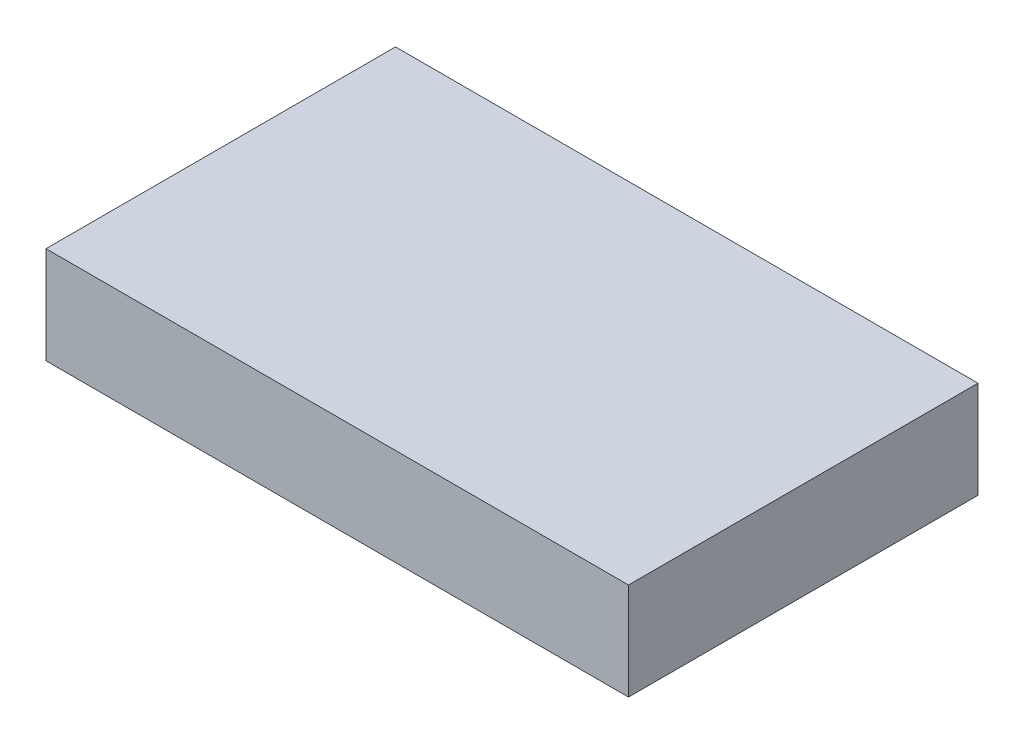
ISO-10303-21;
HEADER;
FILE_DESCRIPTION(('STEP AP214'),'2;1');
FILE_NAME('part.step','',(''),(''),'','','');
FILE_SCHEMA(('AUTOMOTIVE_DESIGN { 1 0 10303 214 1 1 1 1 }'));
ENDSEC;
DATA;
#1=APPLICATION_CONTEXT('core data for automotive mechanical design processes');
#2=APPLICATION_PROTOCOL_DEFINITION('international standard','automotive_design',2000,#1);
#3=PRODUCT_CONTEXT('',#1,'mechanical');
#4=PRODUCT('Part','Part','',(#3));
#5=PRODUCT_RELATED_PRODUCT_CATEGORY('part','',(#4));
#6=PRODUCT_DEFINITION_FORMATION('','',#4);
#7=PRODUCT_DEFINITION_CONTEXT('part definition',#1,'design');
#8=PRODUCT_DEFINITION('design','',#6,#7);
#9=PRODUCT_DEFINITION_SHAPE('','',#8);
#10=(LENGTH_UNIT() NAMED_UNIT(*) SI_UNIT(.MILLI.,.METRE.));
#11=(NAMED_UNIT(*) PLANE_ANGLE_UNIT() SI_UNIT($,.RADIAN.));
#12=(NAMED_UNIT(*) SI_UNIT($,.STERADIAN.) SOLID_ANGLE_UNIT());
#13=UNCERTAINTY_MEASURE_WITH_UNIT(LENGTH_MEASURE(1.E-05),#10,'distance_accuracy_value','');
#14=(GEOMETRIC_REPRESENTATION_CONTEXT(3) GLOBAL_UNCERTAINTY_ASSIGNED_CONTEXT((#13)) GLOBAL_UNIT_ASSIGNED_CONTEXT((#10,
#11,#12)) REPRESENTATION_CONTEXT('',''));
#15=CARTESIAN_POINT('',(0.,0.,0.));
#16=DIRECTION('',(0.,0.,1.));
#17=DIRECTION('',(1.,0.,0.));
#18=AXIS2_PLACEMENT_3D('',#15,#16,#17);
#19=CARTESIAN_POINT('',(0.,0.,90.));
#20=DIRECTION('',(1.,0.,0.));
#21=DIRECTION('',(0.,0.,-1.));
#22=AXIS2_PLACEMENT_3D('',#19,#20,#21);
#23=PLANE('',#22);
#24=DIRECTION('',(0.,-1.,0.));
#25=VECTOR('',#24,1.);
#26=CARTESIAN_POINT('',(0.,0.,0.));
#27=LINE('',#26,#25);
#28=CARTESIAN_POINT('',(0.,25.,0.));
#29=VERTEX_POINT('',#28);
#30=CARTESIAN_POINT('',(0.,0.,0.));
#31=VERTEX_POINT('',#30);
#32=EDGE_CURVE('E105',#29,#31,#27,.T.);
#33=ORIENTED_EDGE('',*,*,#32,.T.);
#34=DIRECTION('',(0.,0.,-1.));
#35=VECTOR('',#34,1.);
#36=CARTESIAN_POINT('',(0.,0.,90.));
#37=LINE('',#36,#35);
#38=CARTESIAN_POINT('',(0.,0.,90.));
#39=VERTEX_POINT('',#38);
#40=EDGE_CURVE('E11',#39,#31,#37,.T.);
#41=ORIENTED_EDGE('',*,*,#40,.F.);
#42=DIRECTION('',(0.,-1.,0.));
#43=VECTOR('',#42,1.);
#44=CARTESIAN_POINT('',(0.,0.,90.));
#45=LINE('',#44,#43);
#46=CARTESIAN_POINT('',(0.,25.,90.));
#47=VERTEX_POINT('',#46);
#48=EDGE_CURVE('E89',#47,#39,#45,.T.);
#49=ORIENTED_EDGE('',*,*,#48,.F.);
#50=DIRECTION('',(0.,0.,-1.));
#51=VECTOR('',#50,1.);
#52=CARTESIAN_POINT('',(0.,25.,90.));
#53=LINE('',#52,#51);
#54=EDGE_CURVE('E98',#47,#29,#53,.T.);
#55=ORIENTED_EDGE('',*,*,#54,.T.);
#56=EDGE_LOOP('',(#33,#41,#49,#55));
#57=FACE_BOUND('',#56,.T.);
#58=ADVANCED_FACE('F39',(#57),#23,.F.);
#59=CARTESIAN_POINT('',(0.,0.,90.));
#60=DIRECTION('',(0.,1.,0.));
#61=DIRECTION('',(0.,0.,1.));
#62=AXIS2_PLACEMENT_3D('',#59,#60,#61);
#63=PLANE('',#62);
#64=DIRECTION('',(1.,0.,0.));
#65=VECTOR('',#64,1.);
#66=CARTESIAN_POINT('',(0.,0.,0.));
#67=LINE('',#66,#65);
#68=CARTESIAN_POINT('',(150.,0.,0.));
#69=VERTEX_POINT('',#68);
#70=EDGE_CURVE('E94',#31,#69,#67,.T.);
#71=ORIENTED_EDGE('',*,*,#70,.T.);
#72=DIRECTION('',(0.,0.,-1.));
#73=VECTOR('',#72,1.);
#74=CARTESIAN_POINT('',(150.,0.,90.));
#75=LINE('',#74,#73);
#76=CARTESIAN_POINT('',(150.,0.,90.));
#77=VERTEX_POINT('',#76);
#78=EDGE_CURVE('E50',#77,#69,#75,.T.);
#79=ORIENTED_EDGE('',*,*,#78,.F.);
#80=DIRECTION('',(1.,0.,0.));
#81=VECTOR('',#80,1.);
#82=CARTESIAN_POINT('',(0.,0.,90.));
#83=LINE('',#82,#81);
#84=EDGE_CURVE('E83',#39,#77,#83,.T.);
#85=ORIENTED_EDGE('',*,*,#84,.F.);
#86=ORIENTED_EDGE('',*,*,#40,.T.);
#87=EDGE_LOOP('',(#71,#79,#85,#86));
#88=FACE_BOUND('',#87,.T.);
#89=ADVANCED_FACE('F91',(#88),#63,.F.);
#90=CARTESIAN_POINT('',(150.,0.,90.));
#91=DIRECTION('',(-1.,0.,0.));
#92=DIRECTION('',(0.,0.,1.));
#93=AXIS2_PLACEMENT_3D('',#90,#91,#92);
#94=PLANE('',#93);
#95=DIRECTION('',(0.,1.,0.));
#96=VECTOR('',#95,1.);
#97=CARTESIAN_POINT('',(150.,0.,0.));
#98=LINE('',#97,#96);
#99=CARTESIAN_POINT('',(150.,25.,0.));
#100=VERTEX_POINT('',#99);
#101=EDGE_CURVE('E75',#69,#100,#98,.T.);
#102=ORIENTED_EDGE('',*,*,#101,.T.);
#103=DIRECTION('',(0.,0.,-1.));
#104=VECTOR('',#103,1.);
#105=CARTESIAN_POINT('',(150.,25.,90.));
#106=LINE('',#105,#104);
#107=CARTESIAN_POINT('',(150.,25.,90.));
#108=VERTEX_POINT('',#107);
#109=EDGE_CURVE('E92',#108,#100,#106,.T.);
#110=ORIENTED_EDGE('',*,*,#109,.F.);
#111=DIRECTION('',(0.,1.,0.));
#112=VECTOR('',#111,1.);
#113=CARTESIAN_POINT('',(150.,0.,90.));
#114=LINE('',#113,#112);
#115=EDGE_CURVE('E86',#77,#108,#114,.T.);
#116=ORIENTED_EDGE('',*,*,#115,.F.);
#117=ORIENTED_EDGE('',*,*,#78,.T.);
#118=EDGE_LOOP('',(#102,#110,#116,#117));
#119=FACE_BOUND('',#118,.T.);
#120=ADVANCED_FACE('F96',(#119),#94,.F.);
#121=CARTESIAN_POINT('',(0.,25.,90.));
#122=DIRECTION('',(0.,-1.,0.));
#123=DIRECTION('',(0.,0.,-1.));
#124=AXIS2_PLACEMENT_3D('',#121,#122,#123);
#125=PLANE('',#124);
#126=DIRECTION('',(-1.,0.,0.));
#127=VECTOR('',#126,1.);
#128=CARTESIAN_POINT('',(0.,25.,0.));
#129=LINE('',#128,#127);
#130=EDGE_CURVE('E77',#100,#29,#129,.T.);
#131=ORIENTED_EDGE('',*,*,#130,.T.);
#132=ORIENTED_EDGE('',*,*,#54,.F.);
#133=DIRECTION('',(-1.,0.,0.));
#134=VECTOR('',#133,1.);
#135=CARTESIAN_POINT('',(0.,25.,90.));
#136=LINE('',#135,#134);
#137=EDGE_CURVE('E54',#108,#47,#136,.T.);
#138=ORIENTED_EDGE('',*,*,#137,.F.);
#139=ORIENTED_EDGE('',*,*,#109,.T.);
#140=EDGE_LOOP('',(#131,#132,#138,#139));
#141=FACE_BOUND('',#140,.T.);
#142=ADVANCED_FACE('F108',(#141),#125,.F.);
#143=CARTESIAN_POINT('',(0.,0.,90.));
#144=DIRECTION('',(0.,0.,-1.));
#145=DIRECTION('',(-1.,0.,0.));
#146=AXIS2_PLACEMENT_3D('',#143,#144,#145);
#147=PLANE('',#146);
#148=ORIENTED_EDGE('',*,*,#48,.T.);
#149=ORIENTED_EDGE('',*,*,#84,.T.);
#150=ORIENTED_EDGE('',*,*,#115,.T.);
#151=ORIENTED_EDGE('',*,*,#137,.T.);
#152=EDGE_LOOP('',(#148,#149,#150,#151));
#153=FACE_BOUND('',#152,.T.);
#154=ADVANCED_FACE('F88',(#153),#147,.F.);
#155=CARTESIAN_POINT('',(0.,0.,0.));
#156=DIRECTION('',(0.,0.,-1.));
#157=DIRECTION('',(-1.,0.,0.));
#158=AXIS2_PLACEMENT_3D('',#155,#156,#157);
#159=PLANE('',#158);
#160=ORIENTED_EDGE('',*,*,#32,.F.);
#161=ORIENTED_EDGE('',*,*,#130,.F.);
#162=ORIENTED_EDGE('',*,*,#101,.F.);
#163=ORIENTED_EDGE('',*,*,#70,.F.);
#164=EDGE_LOOP('',(#160,#161,#162,#163));
#165=FACE_BOUND('',#164,.T.);
#166=ADVANCED_FACE('F115',(#165),#159,.T.);
#167=CLOSED_SHELL('',(#58,#89,#120,#142,#154,#166));
#168=MANIFOLD_SOLID_BREP('B2',#167);
#169=ADVANCED_BREP_SHAPE_REPRESENTATION('',(#18,#168),#14);
#170=SHAPE_DEFINITION_REPRESENTATION(#9,#169);
ENDSEC;
END-ISO-10303-21;
